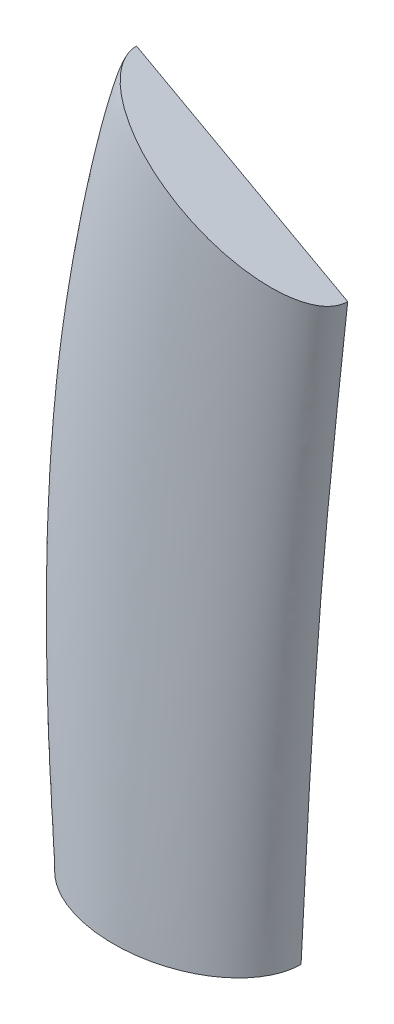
ISO-10303-21;
HEADER;
FILE_DESCRIPTION(('STEP AP214'),'2;1');
FILE_NAME('part.step','',(''),(''),'','','');
FILE_SCHEMA(('AUTOMOTIVE_DESIGN { 1 0 10303 214 1 1 1 1 }'));
ENDSEC;
DATA;
#1=APPLICATION_CONTEXT('core data for automotive mechanical design processes');
#2=APPLICATION_PROTOCOL_DEFINITION('international standard','automotive_design',2000,#1);
#3=PRODUCT_CONTEXT('',#1,'mechanical');
#4=PRODUCT('Part','Part','',(#3));
#5=PRODUCT_RELATED_PRODUCT_CATEGORY('part','',(#4));
#6=PRODUCT_DEFINITION_FORMATION('','',#4);
#7=PRODUCT_DEFINITION_CONTEXT('part definition',#1,'design');
#8=PRODUCT_DEFINITION('design','',#6,#7);
#9=PRODUCT_DEFINITION_SHAPE('','',#8);
#10=(LENGTH_UNIT() NAMED_UNIT(*) SI_UNIT(.MILLI.,.METRE.));
#11=(NAMED_UNIT(*) PLANE_ANGLE_UNIT() SI_UNIT($,.RADIAN.));
#12=(NAMED_UNIT(*) SI_UNIT($,.STERADIAN.) SOLID_ANGLE_UNIT());
#13=UNCERTAINTY_MEASURE_WITH_UNIT(LENGTH_MEASURE(1.E-05),#10,'distance_accuracy_value','');
#14=(GEOMETRIC_REPRESENTATION_CONTEXT(3) GLOBAL_UNCERTAINTY_ASSIGNED_CONTEXT((#13)) GLOBAL_UNIT_ASSIGNED_CONTEXT((#10,
#11,#12)) REPRESENTATION_CONTEXT('',''));
#15=CARTESIAN_POINT('',(0.,0.,0.));
#16=DIRECTION('',(0.,0.,1.));
#17=DIRECTION('',(1.,0.,0.));
#18=AXIS2_PLACEMENT_3D('',#15,#16,#17);
#19=CARTESIAN_POINT('',(40.9185016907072,163.55332077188,0.));
#20=DIRECTION('',(0.480658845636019,0.876907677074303,0.));
#21=DIRECTION('',(-0.876907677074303,0.480658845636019,0.));
#22=AXIS2_PLACEMENT_3D('',#19,#20,#21);
#23=PLANE('',#22);
#24=CARTESIAN_POINT('',(40.9185016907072,163.55332077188,0.));
#25=DIRECTION('',(-0.480658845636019,-0.876907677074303,0.));
#26=DIRECTION('',(-0.876907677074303,0.480658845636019,0.));
#27=AXIS2_PLACEMENT_3D('',#24,#25,#26);
#28=ELLIPSE('',#27,30.0559936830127,15.25);
#29=CARTESIAN_POINT('',(67.2748332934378,149.106641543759,-5.93275428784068E-13));
#30=VERTEX_POINT('',#29);
#31=CARTESIAN_POINT('',(14.5621700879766,178.,0.));
#32=VERTEX_POINT('',#31);
#33=EDGE_CURVE('E86',#30,#32,#28,.T.);
#34=ORIENTED_EDGE('',*,*,#33,.F.);
#35=DIRECTION('',(0.876907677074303,-0.480658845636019,0.));
#36=VECTOR('',#35,1.);
#37=CARTESIAN_POINT('',(67.2748332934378,149.106641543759,-5.93275428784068E-13));
#38=LINE('',#37,#36);
#39=EDGE_CURVE('E13',#32,#30,#38,.T.);
#40=ORIENTED_EDGE('',*,*,#39,.F.);
#41=EDGE_LOOP('',(#34,#40));
#42=FACE_BOUND('',#41,.T.);
#43=ADVANCED_FACE('F76',(#42),#23,.T.);
#44=CARTESIAN_POINT('',(27.8150109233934,0.,0.));
#45=DIRECTION('',(0.,1.,0.));
#46=DIRECTION('',(0.,0.,1.));
#47=AXIS2_PLACEMENT_3D('',#44,#45,#46);
#48=PLANE('',#47);
#49=CARTESIAN_POINT('',(27.8150109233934,0.,0.));
#50=DIRECTION('',(0.,1.,0.));
#51=DIRECTION('',(-1.,0.,0.));
#52=AXIS2_PLACEMENT_3D('',#49,#50,#51);
#53=ELLIPSE('',#52,27.8150109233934,19.);
#54=CARTESIAN_POINT('',(0.,0.,0.));
#55=VERTEX_POINT('',#54);
#56=CARTESIAN_POINT('',(55.6300218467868,0.,0.));
#57=VERTEX_POINT('',#56);
#58=EDGE_CURVE('E111',#55,#57,#53,.T.);
#59=ORIENTED_EDGE('',*,*,#58,.F.);
#60=DIRECTION('',(-1.,0.,0.));
#61=VECTOR('',#60,1.);
#62=CARTESIAN_POINT('',(55.6300218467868,0.,0.));
#63=LINE('',#62,#61);
#64=EDGE_CURVE('E108',#57,#55,#63,.T.);
#65=ORIENTED_EDGE('',*,*,#64,.F.);
#66=EDGE_LOOP('',(#59,#65));
#67=FACE_BOUND('',#66,.T.);
#68=ADVANCED_FACE('F110',(#67),#48,.F.);
#69=CARTESIAN_POINT('',(0.,0.,0.));
#70=CARTESIAN_POINT('',(0.259426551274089,5.22226490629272,0.));
#71=CARTESIAN_POINT('',(-6.44392667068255,52.9101588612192,0.));
#72=CARTESIAN_POINT('',(2.33565377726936,137.140828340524,0.));
#73=CARTESIAN_POINT('',(11.4102009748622,172.60932947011,0.));
#74=CARTESIAN_POINT('',(14.5621700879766,178.,0.));
#75=CARTESIAN_POINT('',(0.,0.,10.4863851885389));
#76=CARTESIAN_POINT('',(0.,4.26241241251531,10.4863851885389));
#77=CARTESIAN_POINT('',(-6.29450474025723,51.8481565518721,10.0813928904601));
#78=CARTESIAN_POINT('',(2.38683228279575,136.547475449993,9.19003792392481));
#79=CARTESIAN_POINT('',(11.4336698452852,172.33723629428,8.7713308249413));
#80=CARTESIAN_POINT('',(14.5621700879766,178.,8.41670390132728));
#81=CARTESIAN_POINT('',(12.4634888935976,0.,19.));
#82=CARTESIAN_POINT('',(12.4634888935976,10.8581139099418,19.));
#83=CARTESIAN_POINT('',(8.51386601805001,54.9066592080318,18.266205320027));
#84=CARTESIAN_POINT('',(16.1884534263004,131.047932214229,16.6511831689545));
#85=CARTESIAN_POINT('',(23.5432157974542,162.973930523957,15.8925390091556));
#86=CARTESIAN_POINT('',(26.3720466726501,171.526659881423,15.2500000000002));
#87=CARTESIAN_POINT('',(43.1665329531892,0.,19.));
#88=CARTESIAN_POINT('',(43.1665329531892,24.0410681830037,19.));
#89=CARTESIAN_POINT('',(43.8474009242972,60.4271832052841,18.2662053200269));
#90=CARTESIAN_POINT('',(49.3780343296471,118.164491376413,16.6511831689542));
#91=CARTESIAN_POINT('',(53.287366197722,141.758920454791,15.8925390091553));
#92=CARTESIAN_POINT('',(55.4649567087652,155.579981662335,15.2499999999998));
#93=CARTESIAN_POINT('',(55.6300218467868,0.,10.4863851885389));
#94=CARTESIAN_POINT('',(55.6300218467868,30.6283209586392,10.4863851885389));
#95=CARTESIAN_POINT('',(58.6557716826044,63.4762398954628,10.0813928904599));
#96=CARTESIAN_POINT('',(63.1796554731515,112.659645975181,9.19003792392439));
#97=CARTESIAN_POINT('',(65.3969121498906,132.39318327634,8.77133082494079));
#98=CARTESIAN_POINT('',(67.2748332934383,149.106641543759,8.41670390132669));
#99=CARTESIAN_POINT('',(55.6300218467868,0.,0.));
#100=CARTESIAN_POINT('',(57.1391312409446,29.6600197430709,-1.17743375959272E-13));
#101=CARTESIAN_POINT('',(58.8051936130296,62.4047916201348,-2.47732500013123E-13));
#102=CARTESIAN_POINT('',(63.2308339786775,112.060990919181,-4.45490976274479E-13));
#103=CARTESIAN_POINT('',(65.4203810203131,132.118658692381,-5.25506076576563E-13));
#104=CARTESIAN_POINT('',(67.2748332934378,149.106641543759,-5.91279785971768E-13));
#105=B_SPLINE_SURFACE_WITH_KNOTS('',3,3,((#69,#70,#71,#72,#73,#74),(#75,#76,#77,#78,#79,#80),
(#81,#82,#83,#84,#85,#86),(#87,#88,#89,#90,#91,#92),(#93,#94,#95,#96,#97,#98),(#99,#100,#101,
#102,#103,#104)),.UNSPECIFIED.,.F.,.F.,.F.,(4,2,4),(4,1,1,4),(0.,0.5,1.),(0.,0.595389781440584,
0.657312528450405,1.),.UNSPECIFIED.);
#106=CARTESIAN_POINT('',(55.6300218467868,0.,0.));
#107=CARTESIAN_POINT('',(57.1391312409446,29.6600197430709,-1.17743375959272E-13));
#108=CARTESIAN_POINT('',(58.8051936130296,62.4047916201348,-2.47732500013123E-13));
#109=CARTESIAN_POINT('',(63.2308339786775,112.060990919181,-4.45490976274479E-13));
#110=CARTESIAN_POINT('',(65.4203810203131,132.118658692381,-5.25506076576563E-13));
#111=CARTESIAN_POINT('',(67.2748332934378,149.106641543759,-5.91279785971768E-13));
#112=B_SPLINE_CURVE_WITH_KNOTS('',3,(#106,#107,#108,#109,#110,#111),.UNSPECIFIED.,.F.,.F.,(4,1,
1,4),(0.,0.595389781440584,0.657312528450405,1.),.UNSPECIFIED.);
#113=EDGE_CURVE('E99',#57,#30,#112,.T.);
#114=CARTESIAN_POINT('',(0.,0.,0.));
#115=CARTESIAN_POINT('',(0.259426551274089,5.22226490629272,0.));
#116=CARTESIAN_POINT('',(-6.44392667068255,52.9101588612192,0.));
#117=CARTESIAN_POINT('',(2.33565377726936,137.140828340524,0.));
#118=CARTESIAN_POINT('',(11.4102009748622,172.60932947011,0.));
#119=CARTESIAN_POINT('',(14.5621700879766,178.,0.));
#120=B_SPLINE_CURVE_WITH_KNOTS('',3,(#114,#115,#116,#117,#118,#119),.UNSPECIFIED.,.F.,.F.,(4,1,
1,4),(0.,0.595389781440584,0.657312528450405,1.),.UNSPECIFIED.);
#121=EDGE_CURVE('E116',#32,#55,#120,.F.);
#122=ORIENTED_EDGE('',*,*,#58,.T.);
#123=ORIENTED_EDGE('',*,*,#113,.T.);
#124=ORIENTED_EDGE('',*,*,#33,.T.);
#125=ORIENTED_EDGE('',*,*,#121,.T.);
#126=EDGE_LOOP('',(#122,#123,#124,#125));
#127=FACE_BOUND('',#126,.T.);
#128=ADVANCED_FACE('F121',(#127),#105,.T.);
#129=CARTESIAN_POINT('',(55.6300218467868,0.,0.));
#130=DIRECTION('',(0.,0.,-1.));
#131=DIRECTION('',(-1.,0.,0.));
#132=AXIS2_PLACEMENT_3D('',#129,#130,#131);
#133=PLANE('',#132);
#134=ORIENTED_EDGE('',*,*,#64,.T.);
#135=ORIENTED_EDGE('',*,*,#121,.F.);
#136=ORIENTED_EDGE('',*,*,#39,.T.);
#137=ORIENTED_EDGE('',*,*,#113,.F.);
#138=EDGE_LOOP('',(#134,#135,#136,#137));
#139=FACE_BOUND('',#138,.T.);
#140=ADVANCED_FACE('F125',(#139),#133,.T.);
#141=CLOSED_SHELL('',(#43,#68,#128,#140));
#142=MANIFOLD_SOLID_BREP('B2',#141);
#143=ADVANCED_BREP_SHAPE_REPRESENTATION('',(#18,#142),#14);
#144=SHAPE_DEFINITION_REPRESENTATION(#9,#143);
ENDSEC;
END-ISO-10303-21;
